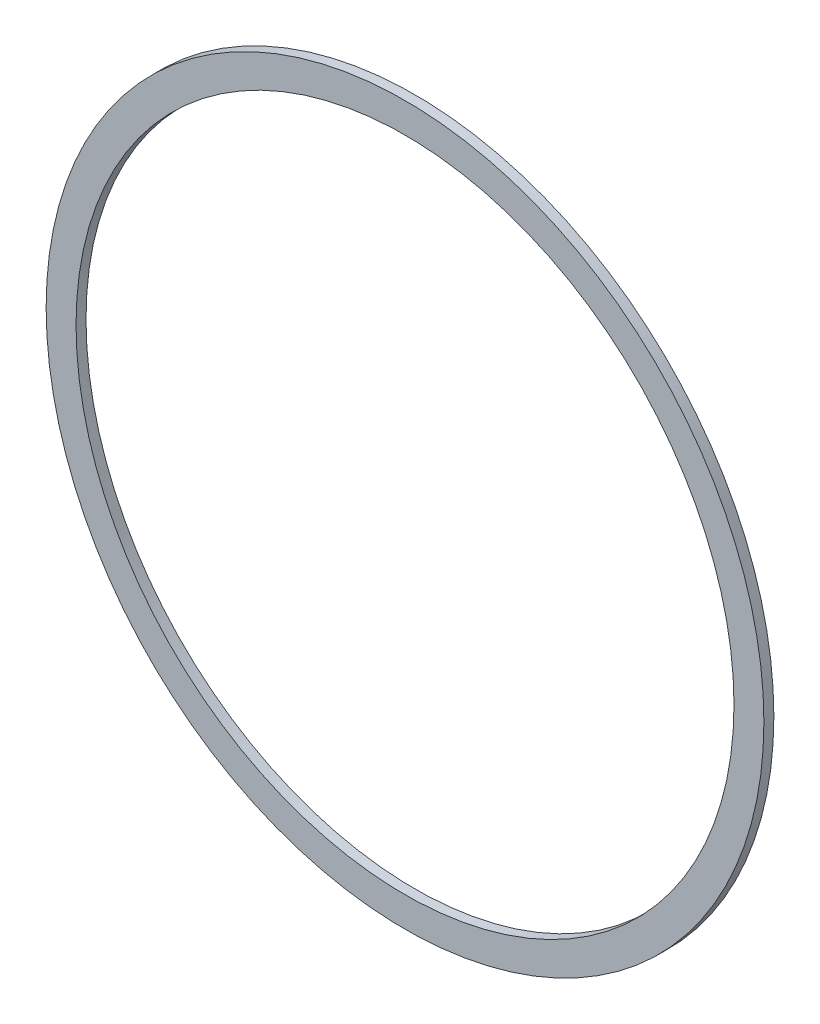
from build123d import *

# Parameters (mm, degrees)
SKETCH_1_R      = 36
SKETCH_1_R_2    = 33
EXTRUDE_1_DEPTH = 1


with BuildPart() as part:
    # Sketch 1 → Extrude 1 (new body)
    with BuildSketch(Plane.XY):
        Circle(SKETCH_1_R)
        Circle(SKETCH_1_R_2, mode=Mode.SUBTRACT)
    extrude(amount=EXTRUDE_1_DEPTH)


solid = part.part
